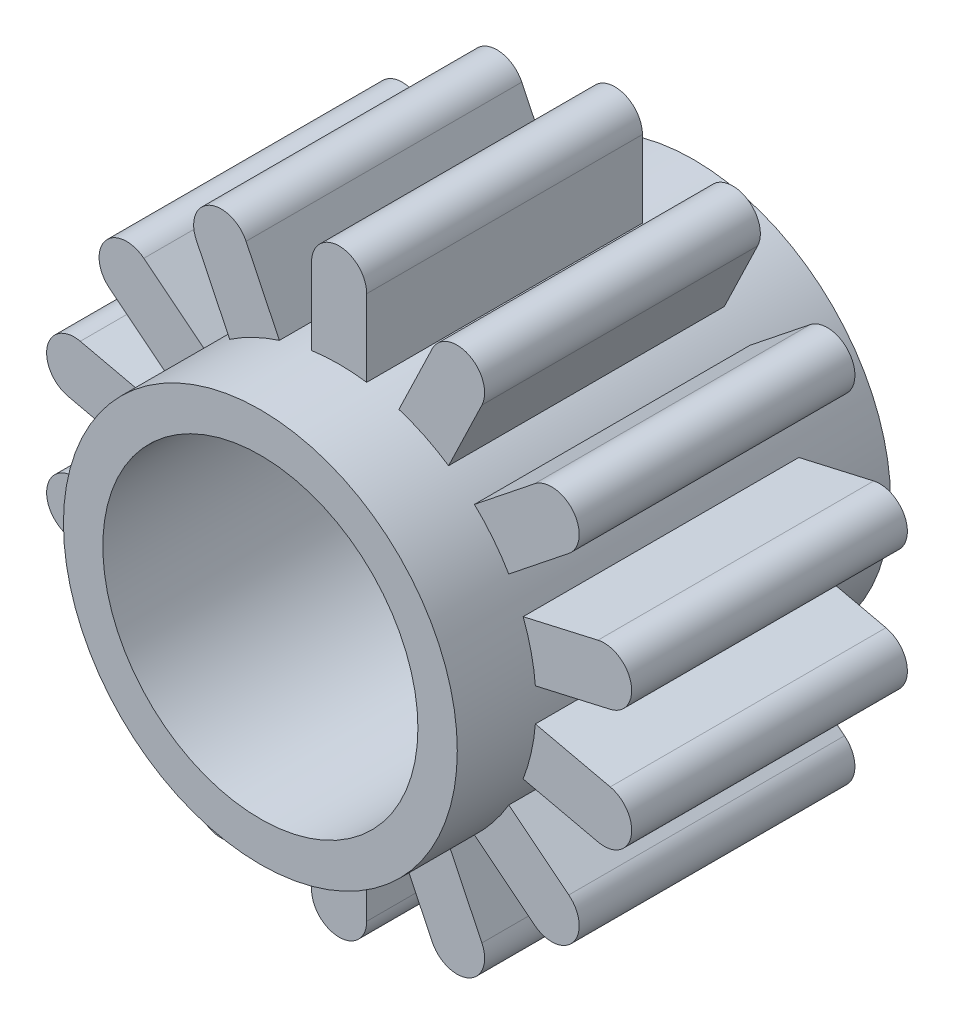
from build123d import *

# Parameters (mm, degrees)
EXTRUDE_1_DEPTH      = 2.75
EXTRUDE_1_DEPTH_BACK = 2.75
SKETCH_1_R           = 2.5
SKETCH_1_R_2         = 2
EXTRUDE_2_DEPTH      = 1.75
EXTRUDE_2_DEPTH_BACK = 1.75


with BuildPart() as part:
    # Sketch 1 → Extrude 1 (new, two sides: drawn at the far end of the back side and taken through both)
    with BuildSketch(Plane.XY.offset(-EXTRUDE_1_DEPTH_BACK)):
        Circle(SKETCH_1_R)
        Circle(SKETCH_1_R_2, mode=Mode.SUBTRACT)
    extrude(amount=EXTRUDE_1_DEPTH + EXTRUDE_1_DEPTH_BACK)

    # Sketch 2 → Extrude 2 (add, two sides: drawn at the far end of the back side and taken through both)
    with BuildSketch(Plane.XY.offset(-EXTRUDE_2_DEPTH_BACK)):
        with BuildLine():
            Line((0.758687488, 2.382098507), (1.181559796, 3.260201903))
            ThreePointArc((1.181559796, 3.260201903), (1.648758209, 3.423681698), (1.812238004, 2.956483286))
            Line((1.812238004, 2.956483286), (1.389365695, 2.078379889))
            ThreePointArc((1.389365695, 2.078379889), (1.084709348, 2.25242217), (0.758687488, 2.382098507))
        make_face()
        with BuildLine():
            Line((-0.35, 2.475378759), (-0.35, 3.45))
            ThreePointArc((-0.35, 3.45), (0, 3.8), (0.35, 3.45))
            Line((0.35, 3.45), (0.35, 2.475378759))
            ThreePointArc((0.35, 2.475378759), (0, 2.5), (-0.35, 2.475378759))
        make_face()
        with BuildLine():
            Line((1.717107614, 1.817014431), (2.479097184, 2.424680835))
            ThreePointArc((2.479097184, 2.424680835), (2.970959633, 2.369261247), (2.915540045, 1.877398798))
            Line((2.915540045, 1.877398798), (2.153550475, 1.269732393))
            ThreePointArc((2.153550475, 1.269732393), (1.954578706, 1.558724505), (1.717107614, 1.817014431))
        make_face()
        with BuildLine():
            Line((2.335433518, 0.892048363), (3.28561897, 1.108921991))
            ThreePointArc((3.28561897, 1.108921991), (3.704726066, 0.845579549), (3.441383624, 0.426472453))
            Line((3.441383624, 0.426472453), (2.491198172, 0.209598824))
            ThreePointArc((2.491198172, 0.209598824), (2.43731978, 0.556302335), (2.335433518, 0.892048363))
        make_face()
        with BuildLine():
            Line((2.491198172, -0.209598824), (3.441383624, -0.426472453))
            ThreePointArc((3.441383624, -0.426472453), (3.704726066, -0.845579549), (3.28561897, -1.108921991))
            Line((3.28561897, -1.108921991), (2.335433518, -0.892048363))
            ThreePointArc((2.335433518, -0.892048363), (2.43731978, -0.556302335), (2.491198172, -0.209598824))
        make_face()
        with BuildLine():
            Line((2.153550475, -1.269732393), (2.915540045, -1.877398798))
            ThreePointArc((2.915540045, -1.877398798), (2.970959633, -2.369261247), (2.479097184, -2.424680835))
            Line((2.479097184, -2.424680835), (1.717107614, -1.817014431))
            ThreePointArc((1.717107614, -1.817014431), (1.954578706, -1.558724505), (2.153550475, -1.269732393))
        make_face()
        with BuildLine():
            Line((1.389365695, -2.078379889), (1.812238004, -2.956483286))
            ThreePointArc((1.812238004, -2.956483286), (1.648758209, -3.423681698), (1.181559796, -3.260201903))
            Line((1.181559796, -3.260201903), (0.758687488, -2.382098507))
            ThreePointArc((0.758687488, -2.382098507), (1.084709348, -2.25242217), (1.389365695, -2.078379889))
        make_face()
        with BuildLine():
            Line((0.35, -2.475378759), (0.35, -3.45))
            ThreePointArc((0.35, -3.45), (0, -3.8), (-0.35, -3.45))
            Line((-0.35, -3.45), (-0.35, -2.475378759))
            ThreePointArc((-0.35, -2.475378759), (0, -2.5), (0.35, -2.475378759))
        make_face()
        with BuildLine():
            Line((-0.758687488, -2.382098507), (-1.181559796, -3.260201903))
            ThreePointArc((-1.181559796, -3.260201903), (-1.648758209, -3.423681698), (-1.812238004, -2.956483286))
            Line((-1.812238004, -2.956483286), (-1.389365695, -2.078379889))
            ThreePointArc((-1.389365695, -2.078379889), (-1.084709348, -2.25242217), (-0.758687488, -2.382098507))
        make_face()
        with BuildLine():
            Line((-1.717107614, -1.817014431), (-2.479097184, -2.424680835))
            ThreePointArc((-2.479097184, -2.424680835), (-2.970959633, -2.369261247), (-2.915540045, -1.877398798))
            Line((-2.915540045, -1.877398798), (-2.153550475, -1.269732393))
            ThreePointArc((-2.153550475, -1.269732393), (-1.954578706, -1.558724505), (-1.717107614, -1.817014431))
        make_face()
        with BuildLine():
            Line((-2.335433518, -0.892048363), (-3.28561897, -1.108921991))
            ThreePointArc((-3.28561897, -1.108921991), (-3.704726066, -0.845579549), (-3.441383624, -0.426472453))
            Line((-3.441383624, -0.426472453), (-2.491198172, -0.209598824))
            ThreePointArc((-2.491198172, -0.209598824), (-2.43731978, -0.556302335), (-2.335433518, -0.892048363))
        make_face()
        with BuildLine():
            Line((-2.491198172, 0.209598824), (-3.441383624, 0.426472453))
            ThreePointArc((-3.441383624, 0.426472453), (-3.704726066, 0.845579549), (-3.28561897, 1.108921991))
            Line((-3.28561897, 1.108921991), (-2.335433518, 0.892048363))
            ThreePointArc((-2.335433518, 0.892048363), (-2.43731978, 0.556302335), (-2.491198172, 0.209598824))
        make_face()
        with BuildLine():
            Line((-2.153550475, 1.269732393), (-2.915540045, 1.877398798))
            ThreePointArc((-2.915540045, 1.877398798), (-2.970959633, 2.369261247), (-2.479097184, 2.424680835))
            Line((-2.479097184, 2.424680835), (-1.717107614, 1.817014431))
            ThreePointArc((-1.717107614, 1.817014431), (-1.954578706, 1.558724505), (-2.153550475, 1.269732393))
        make_face()
        with BuildLine():
            Line((-1.389365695, 2.078379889), (-1.812238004, 2.956483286))
            ThreePointArc((-1.812238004, 2.956483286), (-1.648758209, 3.423681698), (-1.181559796, 3.260201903))
            Line((-1.181559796, 3.260201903), (-0.758687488, 2.382098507))
            ThreePointArc((-0.758687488, 2.382098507), (-1.084709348, 2.25242217), (-1.389365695, 2.078379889))
        make_face()
    extrude(amount=EXTRUDE_2_DEPTH + EXTRUDE_2_DEPTH_BACK)


solid = part.part
